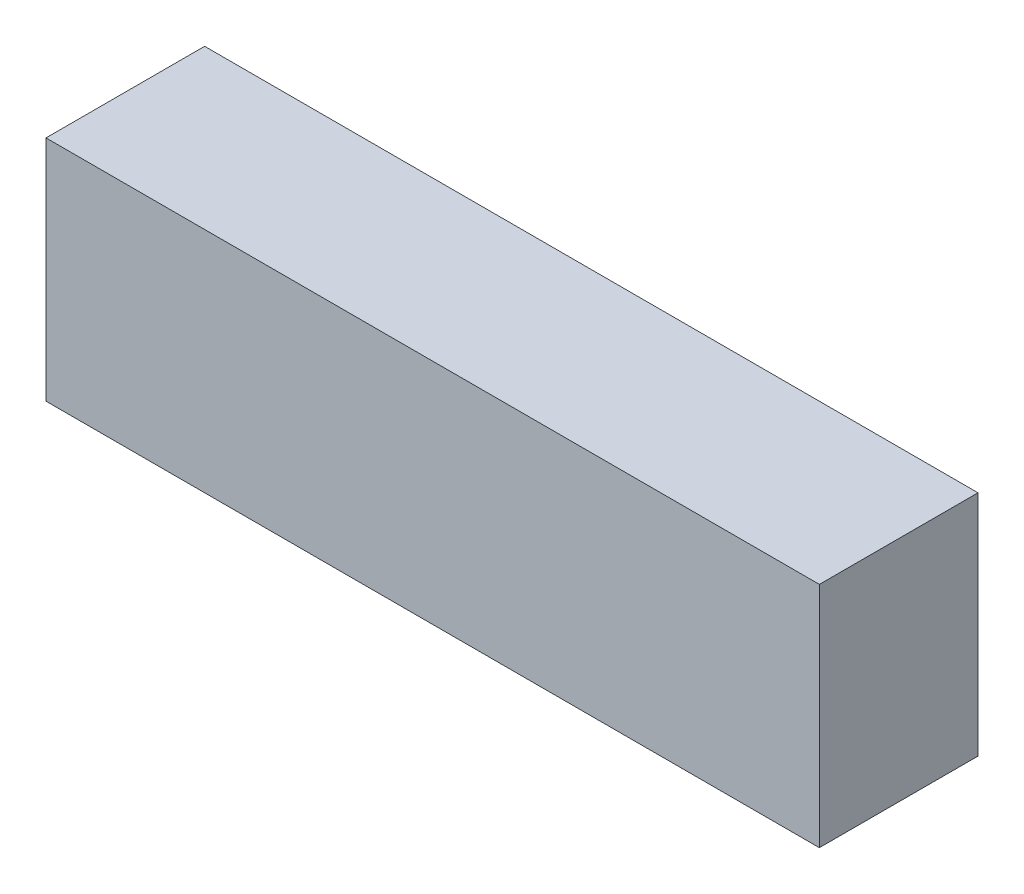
ISO-10303-21;
HEADER;
FILE_DESCRIPTION(('STEP AP214'),'2;1');
FILE_NAME('part.step','',(''),(''),'','','');
FILE_SCHEMA(('AUTOMOTIVE_DESIGN { 1 0 10303 214 1 1 1 1 }'));
ENDSEC;
DATA;
#1=APPLICATION_CONTEXT('core data for automotive mechanical design processes');
#2=APPLICATION_PROTOCOL_DEFINITION('international standard','automotive_design',2000,#1);
#3=PRODUCT_CONTEXT('',#1,'mechanical');
#4=PRODUCT('Part','Part','',(#3));
#5=PRODUCT_RELATED_PRODUCT_CATEGORY('part','',(#4));
#6=PRODUCT_DEFINITION_FORMATION('','',#4);
#7=PRODUCT_DEFINITION_CONTEXT('part definition',#1,'design');
#8=PRODUCT_DEFINITION('design','',#6,#7);
#9=PRODUCT_DEFINITION_SHAPE('','',#8);
#10=(LENGTH_UNIT() NAMED_UNIT(*) SI_UNIT(.MILLI.,.METRE.));
#11=(NAMED_UNIT(*) PLANE_ANGLE_UNIT() SI_UNIT($,.RADIAN.));
#12=(NAMED_UNIT(*) SI_UNIT($,.STERADIAN.) SOLID_ANGLE_UNIT());
#13=UNCERTAINTY_MEASURE_WITH_UNIT(LENGTH_MEASURE(1.E-05),#10,'distance_accuracy_value','');
#14=(GEOMETRIC_REPRESENTATION_CONTEXT(3) GLOBAL_UNCERTAINTY_ASSIGNED_CONTEXT((#13)) GLOBAL_UNIT_ASSIGNED_CONTEXT((#10,
#11,#12)) REPRESENTATION_CONTEXT('',''));
#15=CARTESIAN_POINT('',(0.,0.,0.));
#16=DIRECTION('',(0.,0.,1.));
#17=DIRECTION('',(1.,0.,0.));
#18=AXIS2_PLACEMENT_3D('',#15,#16,#17);
#19=CARTESIAN_POINT('',(78.,46.,16.));
#20=DIRECTION('',(-1.,0.,0.));
#21=DIRECTION('',(0.,0.,1.));
#22=AXIS2_PLACEMENT_3D('',#19,#20,#21);
#23=PLANE('',#22);
#24=DIRECTION('',(0.,0.,-1.));
#25=VECTOR('',#24,1.);
#26=CARTESIAN_POINT('',(78.,0.,16.));
#27=LINE('',#26,#25);
#28=CARTESIAN_POINT('',(78.,0.,16.));
#29=VERTEX_POINT('',#28);
#30=CARTESIAN_POINT('',(78.,0.,-16.));
#31=VERTEX_POINT('',#30);
#32=EDGE_CURVE('E94',#29,#31,#27,.T.);
#33=ORIENTED_EDGE('',*,*,#32,.T.);
#34=DIRECTION('',(0.,-1.,0.));
#35=VECTOR('',#34,1.);
#36=CARTESIAN_POINT('',(78.,46.,-16.));
#37=LINE('',#36,#35);
#38=CARTESIAN_POINT('',(78.,46.,-16.));
#39=VERTEX_POINT('',#38);
#40=EDGE_CURVE('E11',#39,#31,#37,.T.);
#41=ORIENTED_EDGE('',*,*,#40,.F.);
#42=DIRECTION('',(0.,0.,-1.));
#43=VECTOR('',#42,1.);
#44=CARTESIAN_POINT('',(78.,46.,16.));
#45=LINE('',#44,#43);
#46=CARTESIAN_POINT('',(78.,46.,16.));
#47=VERTEX_POINT('',#46);
#48=EDGE_CURVE('E82',#47,#39,#45,.T.);
#49=ORIENTED_EDGE('',*,*,#48,.F.);
#50=DIRECTION('',(0.,-1.,0.));
#51=VECTOR('',#50,1.);
#52=CARTESIAN_POINT('',(78.,46.,16.));
#53=LINE('',#52,#51);
#54=EDGE_CURVE('E90',#47,#29,#53,.T.);
#55=ORIENTED_EDGE('',*,*,#54,.T.);
#56=EDGE_LOOP('',(#33,#41,#49,#55));
#57=FACE_BOUND('',#56,.T.);
#58=ADVANCED_FACE('F31',(#57),#23,.F.);
#59=CARTESIAN_POINT('',(-78.,46.,-16.));
#60=DIRECTION('',(0.,0.,1.));
#61=DIRECTION('',(1.,0.,0.));
#62=AXIS2_PLACEMENT_3D('',#59,#60,#61);
#63=PLANE('',#62);
#64=DIRECTION('',(-1.,0.,0.));
#65=VECTOR('',#64,1.);
#66=CARTESIAN_POINT('',(-78.,0.,-16.));
#67=LINE('',#66,#65);
#68=CARTESIAN_POINT('',(-78.,0.,-16.));
#69=VERTEX_POINT('',#68);
#70=EDGE_CURVE('E86',#31,#69,#67,.T.);
#71=ORIENTED_EDGE('',*,*,#70,.T.);
#72=DIRECTION('',(0.,-1.,0.));
#73=VECTOR('',#72,1.);
#74=CARTESIAN_POINT('',(-78.,46.,-16.));
#75=LINE('',#74,#73);
#76=CARTESIAN_POINT('',(-78.,46.,-16.));
#77=VERTEX_POINT('',#76);
#78=EDGE_CURVE('E39',#77,#69,#75,.T.);
#79=ORIENTED_EDGE('',*,*,#78,.F.);
#80=DIRECTION('',(-1.,0.,0.));
#81=VECTOR('',#80,1.);
#82=CARTESIAN_POINT('',(-78.,46.,-16.));
#83=LINE('',#82,#81);
#84=EDGE_CURVE('E77',#39,#77,#83,.T.);
#85=ORIENTED_EDGE('',*,*,#84,.F.);
#86=ORIENTED_EDGE('',*,*,#40,.T.);
#87=EDGE_LOOP('',(#71,#79,#85,#86));
#88=FACE_BOUND('',#87,.T.);
#89=ADVANCED_FACE('F85',(#88),#63,.F.);
#90=CARTESIAN_POINT('',(-78.,46.,16.));
#91=DIRECTION('',(1.,0.,0.));
#92=DIRECTION('',(0.,0.,-1.));
#93=AXIS2_PLACEMENT_3D('',#90,#91,#92);
#94=PLANE('',#93);
#95=DIRECTION('',(0.,0.,1.));
#96=VECTOR('',#95,1.);
#97=CARTESIAN_POINT('',(-78.,0.,16.));
#98=LINE('',#97,#96);
#99=CARTESIAN_POINT('',(-78.,0.,16.));
#100=VERTEX_POINT('',#99);
#101=EDGE_CURVE('E64',#69,#100,#98,.T.);
#102=ORIENTED_EDGE('',*,*,#101,.T.);
#103=DIRECTION('',(0.,-1.,0.));
#104=VECTOR('',#103,1.);
#105=CARTESIAN_POINT('',(-78.,46.,16.));
#106=LINE('',#105,#104);
#107=CARTESIAN_POINT('',(-78.,46.,16.));
#108=VERTEX_POINT('',#107);
#109=EDGE_CURVE('E87',#108,#100,#106,.T.);
#110=ORIENTED_EDGE('',*,*,#109,.F.);
#111=DIRECTION('',(0.,0.,1.));
#112=VECTOR('',#111,1.);
#113=CARTESIAN_POINT('',(-78.,46.,16.));
#114=LINE('',#113,#112);
#115=EDGE_CURVE('E80',#77,#108,#114,.T.);
#116=ORIENTED_EDGE('',*,*,#115,.F.);
#117=ORIENTED_EDGE('',*,*,#78,.T.);
#118=EDGE_LOOP('',(#102,#110,#116,#117));
#119=FACE_BOUND('',#118,.T.);
#120=ADVANCED_FACE('F88',(#119),#94,.F.);
#121=CARTESIAN_POINT('',(-78.,46.,16.));
#122=DIRECTION('',(0.,0.,-1.));
#123=DIRECTION('',(-1.,0.,0.));
#124=AXIS2_PLACEMENT_3D('',#121,#122,#123);
#125=PLANE('',#124);
#126=DIRECTION('',(1.,0.,0.));
#127=VECTOR('',#126,1.);
#128=CARTESIAN_POINT('',(-78.,0.,16.));
#129=LINE('',#128,#127);
#130=EDGE_CURVE('E70',#100,#29,#129,.T.);
#131=ORIENTED_EDGE('',*,*,#130,.T.);
#132=ORIENTED_EDGE('',*,*,#54,.F.);
#133=DIRECTION('',(1.,0.,0.));
#134=VECTOR('',#133,1.);
#135=CARTESIAN_POINT('',(-78.,46.,16.));
#136=LINE('',#135,#134);
#137=EDGE_CURVE('E47',#108,#47,#136,.T.);
#138=ORIENTED_EDGE('',*,*,#137,.F.);
#139=ORIENTED_EDGE('',*,*,#109,.T.);
#140=EDGE_LOOP('',(#131,#132,#138,#139));
#141=FACE_BOUND('',#140,.T.);
#142=ADVANCED_FACE('F101',(#141),#125,.F.);
#143=CARTESIAN_POINT('',(78.,46.,-16.));
#144=DIRECTION('',(0.,-1.,0.));
#145=DIRECTION('',(0.,0.,-1.));
#146=AXIS2_PLACEMENT_3D('',#143,#144,#145);
#147=PLANE('',#146);
#148=ORIENTED_EDGE('',*,*,#48,.T.);
#149=ORIENTED_EDGE('',*,*,#84,.T.);
#150=ORIENTED_EDGE('',*,*,#115,.T.);
#151=ORIENTED_EDGE('',*,*,#137,.T.);
#152=EDGE_LOOP('',(#148,#149,#150,#151));
#153=FACE_BOUND('',#152,.T.);
#154=ADVANCED_FACE('F78',(#153),#147,.F.);
#155=CARTESIAN_POINT('',(78.,0.,-16.));
#156=DIRECTION('',(0.,-1.,0.));
#157=DIRECTION('',(0.,0.,-1.));
#158=AXIS2_PLACEMENT_3D('',#155,#156,#157);
#159=PLANE('',#158);
#160=ORIENTED_EDGE('',*,*,#32,.F.);
#161=ORIENTED_EDGE('',*,*,#130,.F.);
#162=ORIENTED_EDGE('',*,*,#101,.F.);
#163=ORIENTED_EDGE('',*,*,#70,.F.);
#164=EDGE_LOOP('',(#160,#161,#162,#163));
#165=FACE_BOUND('',#164,.T.);
#166=ADVANCED_FACE('F104',(#165),#159,.T.);
#167=CLOSED_SHELL('',(#58,#89,#120,#142,#154,#166));
#168=MANIFOLD_SOLID_BREP('B2',#167);
#169=ADVANCED_BREP_SHAPE_REPRESENTATION('',(#18,#168),#14);
#170=SHAPE_DEFINITION_REPRESENTATION(#9,#169);
ENDSEC;
END-ISO-10303-21;
